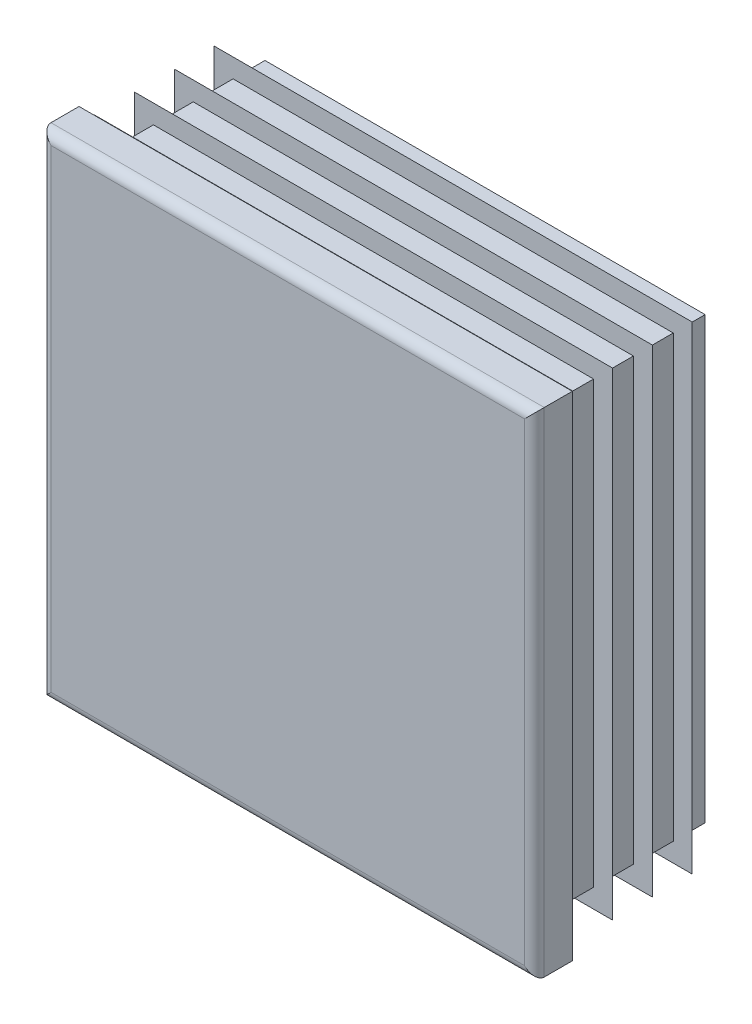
ISO-10303-21;
HEADER;
FILE_DESCRIPTION(('STEP AP214'),'2;1');
FILE_NAME('part.step','',(''),(''),'','','');
FILE_SCHEMA(('AUTOMOTIVE_DESIGN { 1 0 10303 214 1 1 1 1 }'));
ENDSEC;
DATA;
#1=APPLICATION_CONTEXT('core data for automotive mechanical design processes');
#2=APPLICATION_PROTOCOL_DEFINITION('international standard','automotive_design',2000,#1);
#3=PRODUCT_CONTEXT('',#1,'mechanical');
#4=PRODUCT('Part','Part','',(#3));
#5=PRODUCT_RELATED_PRODUCT_CATEGORY('part','',(#4));
#6=PRODUCT_DEFINITION_FORMATION('','',#4);
#7=PRODUCT_DEFINITION_CONTEXT('part definition',#1,'design');
#8=PRODUCT_DEFINITION('design','',#6,#7);
#9=PRODUCT_DEFINITION_SHAPE('','',#8);
#10=(LENGTH_UNIT() NAMED_UNIT(*) SI_UNIT(.MILLI.,.METRE.));
#11=(NAMED_UNIT(*) PLANE_ANGLE_UNIT() SI_UNIT($,.RADIAN.));
#12=(NAMED_UNIT(*) SI_UNIT($,.STERADIAN.) SOLID_ANGLE_UNIT());
#13=UNCERTAINTY_MEASURE_WITH_UNIT(LENGTH_MEASURE(1.E-05),#10,'distance_accuracy_value','');
#14=(GEOMETRIC_REPRESENTATION_CONTEXT(3) GLOBAL_UNCERTAINTY_ASSIGNED_CONTEXT((#13)) GLOBAL_UNIT_ASSIGNED_CONTEXT((#10,
#11,#12)) REPRESENTATION_CONTEXT('',''));
#15=CARTESIAN_POINT('',(0.,0.,0.));
#16=DIRECTION('',(0.,0.,1.));
#17=DIRECTION('',(1.,0.,0.));
#18=AXIS2_PLACEMENT_3D('',#15,#16,#17);
#19=CARTESIAN_POINT('',(31.2,-32.5,5.));
#20=DIRECTION('',(0.,0.,-1.));
#21=DIRECTION('',(0.,1.,0.));
#22=AXIS2_PLACEMENT_3D('',#19,#20,#21);
#23=PLANE('',#22);
#24=DIRECTION('',(0.,1.,0.));
#25=VECTOR('',#24,1.);
#26=CARTESIAN_POINT('',(-31.2,-32.5,5.));
#27=LINE('',#26,#25);
#28=CARTESIAN_POINT('',(-31.2,-31.2,5.));
#29=VERTEX_POINT('',#28);
#30=CARTESIAN_POINT('',(-31.2,31.2,5.));
#31=VERTEX_POINT('',#30);
#32=EDGE_CURVE('E262',#29,#31,#27,.T.);
#33=ORIENTED_EDGE('',*,*,#32,.F.);
#34=DIRECTION('',(-1.,0.,0.));
#35=VECTOR('',#34,1.);
#36=CARTESIAN_POINT('',(32.5,-31.2,5.));
#37=LINE('',#36,#35);
#38=CARTESIAN_POINT('',(31.2,-31.2,5.));
#39=VERTEX_POINT('',#38);
#40=EDGE_CURVE('E432',#39,#29,#37,.T.);
#41=ORIENTED_EDGE('',*,*,#40,.F.);
#42=DIRECTION('',(0.,1.,0.));
#43=VECTOR('',#42,1.);
#44=CARTESIAN_POINT('',(31.2,-32.5,5.));
#45=LINE('',#44,#43);
#46=CARTESIAN_POINT('',(31.2,31.2,5.));
#47=VERTEX_POINT('',#46);
#48=EDGE_CURVE('E257',#39,#47,#45,.T.);
#49=ORIENTED_EDGE('',*,*,#48,.T.);
#50=DIRECTION('',(-1.,0.,0.));
#51=VECTOR('',#50,1.);
#52=CARTESIAN_POINT('',(32.5,31.2,5.));
#53=LINE('',#52,#51);
#54=EDGE_CURVE('E534',#47,#31,#53,.T.);
#55=ORIENTED_EDGE('',*,*,#54,.T.);
#56=EDGE_LOOP('',(#33,#41,#49,#55));
#57=FACE_BOUND('',#56,.T.);
#58=ADVANCED_FACE('F14',(#57),#23,.F.);
#59=CARTESIAN_POINT('',(-31.2,-32.5,3.7));
#60=DIRECTION('',(0.,1.,0.));
#61=DIRECTION('',(-1.,0.,0.));
#62=AXIS2_PLACEMENT_3D('',#59,#60,#61);
#63=CYLINDRICAL_SURFACE('',#62,1.3);
#64=DIRECTION('',(0.,1.,0.));
#65=VECTOR('',#64,1.);
#66=CARTESIAN_POINT('',(-32.5,-32.5,3.7));
#67=LINE('',#66,#65);
#68=CARTESIAN_POINT('',(-32.5,-32.5,3.7));
#69=VERTEX_POINT('',#68);
#70=CARTESIAN_POINT('',(-32.5,32.5,3.7));
#71=VERTEX_POINT('',#70);
#72=EDGE_CURVE('E354',#69,#71,#67,.T.);
#73=ORIENTED_EDGE('',*,*,#72,.F.);
#74=CARTESIAN_POINT('',(-31.2,-31.2,3.7));
#75=DIRECTION('',(-0.707106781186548,0.707106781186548,0.));
#76=DIRECTION('',(0.707106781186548,0.707106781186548,0.));
#77=AXIS2_PLACEMENT_3D('',#74,#75,#76);
#78=ELLIPSE('',#77,1.83847763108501,1.3);
#79=EDGE_CURVE('E59',#69,#29,#78,.T.);
#80=ORIENTED_EDGE('',*,*,#79,.T.);
#81=ORIENTED_EDGE('',*,*,#32,.T.);
#82=CARTESIAN_POINT('',(-31.2,31.2,3.7));
#83=DIRECTION('',(0.707106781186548,0.707106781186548,0.));
#84=DIRECTION('',(-0.707106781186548,0.707106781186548,0.));
#85=AXIS2_PLACEMENT_3D('',#82,#83,#84);
#86=ELLIPSE('',#85,1.83847763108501,1.3);
#87=EDGE_CURVE('E258',#31,#71,#86,.F.);
#88=ORIENTED_EDGE('',*,*,#87,.T.);
#89=EDGE_LOOP('',(#73,#80,#81,#88));
#90=FACE_BOUND('',#89,.T.);
#91=ADVANCED_FACE('F16',(#90),#63,.T.);
#92=CARTESIAN_POINT('',(-32.5,-32.5,3.7));
#93=DIRECTION('',(1.,0.,0.));
#94=DIRECTION('',(0.,1.,0.));
#95=AXIS2_PLACEMENT_3D('',#92,#93,#94);
#96=PLANE('',#95);
#97=DIRECTION('',(0.,0.,-1.));
#98=VECTOR('',#97,1.);
#99=CARTESIAN_POINT('',(-32.5,32.5,3.7));
#100=LINE('',#99,#98);
#101=CARTESIAN_POINT('',(-32.5,32.5,0.));
#102=VERTEX_POINT('',#101);
#103=EDGE_CURVE('E519',#71,#102,#100,.T.);
#104=ORIENTED_EDGE('',*,*,#103,.T.);
#105=DIRECTION('',(0.,1.,0.));
#106=VECTOR('',#105,1.);
#107=CARTESIAN_POINT('',(-32.5,-32.5,0.));
#108=LINE('',#107,#106);
#109=CARTESIAN_POINT('',(-32.5,-32.5,0.));
#110=VERTEX_POINT('',#109);
#111=EDGE_CURVE('E352',#110,#102,#108,.T.);
#112=ORIENTED_EDGE('',*,*,#111,.F.);
#113=DIRECTION('',(0.,0.,-1.));
#114=VECTOR('',#113,1.);
#115=CARTESIAN_POINT('',(-32.5,-32.5,3.7));
#116=LINE('',#115,#114);
#117=EDGE_CURVE('E520',#69,#110,#116,.T.);
#118=ORIENTED_EDGE('',*,*,#117,.F.);
#119=ORIENTED_EDGE('',*,*,#72,.T.);
#120=EDGE_LOOP('',(#104,#112,#118,#119));
#121=FACE_BOUND('',#120,.T.);
#122=ADVANCED_FACE('F604',(#121),#96,.F.);
#123=CARTESIAN_POINT('',(-29.,-32.5,0.));
#124=DIRECTION('',(1.,0.,0.));
#125=DIRECTION('',(0.,1.,0.));
#126=AXIS2_PLACEMENT_3D('',#123,#124,#125);
#127=PLANE('',#126);
#128=DIRECTION('',(0.,1.,0.));
#129=VECTOR('',#128,1.);
#130=CARTESIAN_POINT('',(-29.,-32.5,0.));
#131=LINE('',#130,#129);
#132=CARTESIAN_POINT('',(-29.,-29.,0.));
#133=VERTEX_POINT('',#132);
#134=CARTESIAN_POINT('',(-29.,29.,0.));
#135=VERTEX_POINT('',#134);
#136=EDGE_CURVE('E349',#133,#135,#131,.T.);
#137=ORIENTED_EDGE('',*,*,#136,.T.);
#138=DIRECTION('',(0.,0.,-1.));
#139=VECTOR('',#138,1.);
#140=CARTESIAN_POINT('',(-29.,29.,0.));
#141=LINE('',#140,#139);
#142=CARTESIAN_POINT('',(-29.,29.,-1.05));
#143=VERTEX_POINT('',#142);
#144=EDGE_CURVE('E445',#135,#143,#141,.T.);
#145=ORIENTED_EDGE('',*,*,#144,.T.);
#146=DIRECTION('',(0.,1.,0.));
#147=VECTOR('',#146,1.);
#148=CARTESIAN_POINT('',(-29.,-32.5,-1.05));
#149=LINE('',#148,#147);
#150=CARTESIAN_POINT('',(-29.,-29.,-1.05));
#151=VERTEX_POINT('',#150);
#152=EDGE_CURVE('E346',#151,#143,#149,.T.);
#153=ORIENTED_EDGE('',*,*,#152,.F.);
#154=DIRECTION('',(0.,0.,1.));
#155=VECTOR('',#154,1.);
#156=CARTESIAN_POINT('',(-29.,-29.,0.));
#157=LINE('',#156,#155);
#158=EDGE_CURVE('E439',#151,#133,#157,.T.);
#159=ORIENTED_EDGE('',*,*,#158,.T.);
#160=EDGE_LOOP('',(#137,#145,#153,#159));
#161=FACE_BOUND('',#160,.T.);
#162=ADVANCED_FACE('F728',(#161),#127,.F.);
#163=CARTESIAN_POINT('',(-31.5,-32.5,-1.05));
#164=DIRECTION('',(0.573576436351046,0.,0.819152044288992));
#165=DIRECTION('',(-0.819152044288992,0.,0.573576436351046));
#166=AXIS2_PLACEMENT_3D('',#163,#164,#165);
#167=PLANE('',#166);
#168=DIRECTION('',(0.,1.,0.));
#169=VECTOR('',#168,1.);
#170=CARTESIAN_POINT('',(-31.5,-32.5,-1.05));
#171=LINE('',#170,#169);
#172=CARTESIAN_POINT('',(-31.5,-31.5,-1.05));
#173=VERTEX_POINT('',#172);
#174=CARTESIAN_POINT('',(-31.5,31.5,-1.05));
#175=VERTEX_POINT('',#174);
#176=EDGE_CURVE('E344',#173,#175,#171,.T.);
#177=ORIENTED_EDGE('',*,*,#176,.T.);
#178=DIRECTION('',(0.633687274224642,-0.633687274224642,-0.443712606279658));
#179=VECTOR('',#178,1.);
#180=CARTESIAN_POINT('',(-5.80018806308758,5.80018806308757,-19.045202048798));
#181=LINE('',#180,#179);
#182=CARTESIAN_POINT('',(-29.,29.,-2.80051884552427));
#183=VERTEX_POINT('',#182);
#184=EDGE_CURVE('E457',#175,#183,#181,.T.);
#185=ORIENTED_EDGE('',*,*,#184,.T.);
#186=DIRECTION('',(0.,1.,0.));
#187=VECTOR('',#186,1.);
#188=CARTESIAN_POINT('',(-29.,-32.5,-2.80051884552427));
#189=LINE('',#188,#187);
#190=CARTESIAN_POINT('',(-29.,-29.,-2.80051884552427));
#191=VERTEX_POINT('',#190);
#192=EDGE_CURVE('E341',#191,#183,#189,.T.);
#193=ORIENTED_EDGE('',*,*,#192,.F.);
#194=DIRECTION('',(-0.633687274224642,-0.633687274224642,0.443712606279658));
#195=VECTOR('',#194,1.);
#196=CARTESIAN_POINT('',(-31.9015595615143,-31.9015595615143,-0.768824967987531));
#197=LINE('',#196,#195);
#198=EDGE_CURVE('E451',#191,#173,#197,.T.);
#199=ORIENTED_EDGE('',*,*,#198,.T.);
#200=EDGE_LOOP('',(#177,#185,#193,#199));
#201=FACE_BOUND('',#200,.T.);
#202=ADVANCED_FACE('F732',(#201),#167,.F.);
#203=CARTESIAN_POINT('',(-29.,-32.5,-2.80051884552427));
#204=DIRECTION('',(1.,0.,0.));
#205=DIRECTION('',(0.,1.,0.));
#206=AXIS2_PLACEMENT_3D('',#203,#204,#205);
#207=PLANE('',#206);
#208=ORIENTED_EDGE('',*,*,#192,.T.);
#209=DIRECTION('',(0.,0.,-1.));
#210=VECTOR('',#209,1.);
#211=CARTESIAN_POINT('',(-29.,29.,-2.80051884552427));
#212=LINE('',#211,#210);
#213=CARTESIAN_POINT('',(-29.,29.,-6.3));
#214=VERTEX_POINT('',#213);
#215=EDGE_CURVE('E463',#183,#214,#212,.T.);
#216=ORIENTED_EDGE('',*,*,#215,.T.);
#217=DIRECTION('',(0.,1.,0.));
#218=VECTOR('',#217,1.);
#219=CARTESIAN_POINT('',(-29.,-32.5,-6.3));
#220=LINE('',#219,#218);
#221=CARTESIAN_POINT('',(-29.,-29.,-6.3));
#222=VERTEX_POINT('',#221);
#223=EDGE_CURVE('E338',#222,#214,#220,.T.);
#224=ORIENTED_EDGE('',*,*,#223,.F.);
#225=DIRECTION('',(0.,0.,1.));
#226=VECTOR('',#225,1.);
#227=CARTESIAN_POINT('',(-29.,-29.,-2.80051884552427));
#228=LINE('',#227,#226);
#229=EDGE_CURVE('E460',#222,#191,#228,.T.);
#230=ORIENTED_EDGE('',*,*,#229,.T.);
#231=EDGE_LOOP('',(#208,#216,#224,#230));
#232=FACE_BOUND('',#231,.T.);
#233=ADVANCED_FACE('F738',(#232),#207,.F.);
#234=CARTESIAN_POINT('',(-31.5,-32.5,-6.3));
#235=DIRECTION('',(0.573576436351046,0.,0.819152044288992));
#236=DIRECTION('',(-0.819152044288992,0.,0.573576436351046));
#237=AXIS2_PLACEMENT_3D('',#234,#235,#236);
#238=PLANE('',#237);
#239=DIRECTION('',(0.,1.,0.));
#240=VECTOR('',#239,1.);
#241=CARTESIAN_POINT('',(-31.5,-32.5,-6.3));
#242=LINE('',#241,#240);
#243=CARTESIAN_POINT('',(-31.5,-31.5,-6.3));
#244=VERTEX_POINT('',#243);
#245=CARTESIAN_POINT('',(-31.5,31.5,-6.3));
#246=VERTEX_POINT('',#245);
#247=EDGE_CURVE('E336',#244,#246,#242,.T.);
#248=ORIENTED_EDGE('',*,*,#247,.T.);
#249=DIRECTION('',(0.633687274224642,-0.633687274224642,-0.443712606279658));
#250=VECTOR('',#249,1.);
#251=CARTESIAN_POINT('',(-5.80018806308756,5.80018806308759,-24.2952020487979));
#252=LINE('',#251,#250);
#253=CARTESIAN_POINT('',(-29.,29.,-8.05051884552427));
#254=VERTEX_POINT('',#253);
#255=EDGE_CURVE('E475',#246,#254,#252,.T.);
#256=ORIENTED_EDGE('',*,*,#255,.T.);
#257=DIRECTION('',(0.,1.,0.));
#258=VECTOR('',#257,1.);
#259=CARTESIAN_POINT('',(-29.,-32.5,-8.05051884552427));
#260=LINE('',#259,#258);
#261=CARTESIAN_POINT('',(-29.,-29.,-8.05051884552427));
#262=VERTEX_POINT('',#261);
#263=EDGE_CURVE('E333',#262,#254,#260,.T.);
#264=ORIENTED_EDGE('',*,*,#263,.F.);
#265=DIRECTION('',(-0.633687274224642,-0.633687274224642,0.443712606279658));
#266=VECTOR('',#265,1.);
#267=CARTESIAN_POINT('',(-31.9015595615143,-31.9015595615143,-6.01882496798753));
#268=LINE('',#267,#266);
#269=EDGE_CURVE('E469',#262,#244,#268,.T.);
#270=ORIENTED_EDGE('',*,*,#269,.T.);
#271=EDGE_LOOP('',(#248,#256,#264,#270));
#272=FACE_BOUND('',#271,.T.);
#273=ADVANCED_FACE('F742',(#272),#238,.F.);
#274=CARTESIAN_POINT('',(-29.,-32.5,-8.05051884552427));
#275=DIRECTION('',(1.,0.,0.));
#276=DIRECTION('',(0.,1.,0.));
#277=AXIS2_PLACEMENT_3D('',#274,#275,#276);
#278=PLANE('',#277);
#279=ORIENTED_EDGE('',*,*,#263,.T.);
#280=DIRECTION('',(0.,0.,-1.));
#281=VECTOR('',#280,1.);
#282=CARTESIAN_POINT('',(-29.,29.,-8.05051884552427));
#283=LINE('',#282,#281);
#284=CARTESIAN_POINT('',(-29.,29.,-11.55));
#285=VERTEX_POINT('',#284);
#286=EDGE_CURVE('E481',#254,#285,#283,.T.);
#287=ORIENTED_EDGE('',*,*,#286,.T.);
#288=DIRECTION('',(0.,1.,0.));
#289=VECTOR('',#288,1.);
#290=CARTESIAN_POINT('',(-29.,-32.5,-11.55));
#291=LINE('',#290,#289);
#292=CARTESIAN_POINT('',(-29.,-29.,-11.55));
#293=VERTEX_POINT('',#292);
#294=EDGE_CURVE('E330',#293,#285,#291,.T.);
#295=ORIENTED_EDGE('',*,*,#294,.F.);
#296=DIRECTION('',(0.,0.,1.));
#297=VECTOR('',#296,1.);
#298=CARTESIAN_POINT('',(-29.,-29.,-8.05051884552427));
#299=LINE('',#298,#297);
#300=EDGE_CURVE('E478',#293,#262,#299,.T.);
#301=ORIENTED_EDGE('',*,*,#300,.T.);
#302=EDGE_LOOP('',(#279,#287,#295,#301));
#303=FACE_BOUND('',#302,.T.);
#304=ADVANCED_FACE('F746',(#303),#278,.F.);
#305=CARTESIAN_POINT('',(-31.5,-32.5,-11.55));
#306=DIRECTION('',(0.573576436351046,0.,0.819152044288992));
#307=DIRECTION('',(-0.819152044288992,0.,0.573576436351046));
#308=AXIS2_PLACEMENT_3D('',#305,#306,#307);
#309=PLANE('',#308);
#310=DIRECTION('',(0.,1.,0.));
#311=VECTOR('',#310,1.);
#312=CARTESIAN_POINT('',(-31.5,-32.5,-11.55));
#313=LINE('',#312,#311);
#314=CARTESIAN_POINT('',(-31.5,-31.5,-11.55));
#315=VERTEX_POINT('',#314);
#316=CARTESIAN_POINT('',(-31.5,31.5,-11.55));
#317=VERTEX_POINT('',#316);
#318=EDGE_CURVE('E328',#315,#317,#313,.T.);
#319=ORIENTED_EDGE('',*,*,#318,.T.);
#320=DIRECTION('',(0.633687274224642,-0.633687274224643,-0.443712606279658));
#321=VECTOR('',#320,1.);
#322=CARTESIAN_POINT('',(-5.80018806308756,5.80018806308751,-29.5452020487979));
#323=LINE('',#322,#321);
#324=CARTESIAN_POINT('',(-29.,29.,-13.3005188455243));
#325=VERTEX_POINT('',#324);
#326=EDGE_CURVE('E493',#317,#325,#323,.T.);
#327=ORIENTED_EDGE('',*,*,#326,.T.);
#328=DIRECTION('',(0.,1.,0.));
#329=VECTOR('',#328,1.);
#330=CARTESIAN_POINT('',(-29.,-32.5,-13.3005188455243));
#331=LINE('',#330,#329);
#332=CARTESIAN_POINT('',(-29.,-29.,-13.3005188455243));
#333=VERTEX_POINT('',#332);
#334=EDGE_CURVE('E325',#333,#325,#331,.T.);
#335=ORIENTED_EDGE('',*,*,#334,.F.);
#336=DIRECTION('',(-0.633687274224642,-0.633687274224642,0.443712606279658));
#337=VECTOR('',#336,1.);
#338=CARTESIAN_POINT('',(-31.9015595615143,-31.9015595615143,-11.2688249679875));
#339=LINE('',#338,#337);
#340=EDGE_CURVE('E487',#333,#315,#339,.T.);
#341=ORIENTED_EDGE('',*,*,#340,.T.);
#342=EDGE_LOOP('',(#319,#327,#335,#341));
#343=FACE_BOUND('',#342,.T.);
#344=ADVANCED_FACE('F668',(#343),#309,.F.);
#345=CARTESIAN_POINT('',(-29.,-32.5,-13.3005188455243));
#346=DIRECTION('',(1.,0.,0.));
#347=DIRECTION('',(0.,1.,0.));
#348=AXIS2_PLACEMENT_3D('',#345,#346,#347);
#349=PLANE('',#348);
#350=ORIENTED_EDGE('',*,*,#334,.T.);
#351=DIRECTION('',(0.,0.,-1.));
#352=VECTOR('',#351,1.);
#353=CARTESIAN_POINT('',(-29.,29.,-13.3005188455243));
#354=LINE('',#353,#352);
#355=CARTESIAN_POINT('',(-29.,29.,-16.8));
#356=VERTEX_POINT('',#355);
#357=EDGE_CURVE('E499',#325,#356,#354,.T.);
#358=ORIENTED_EDGE('',*,*,#357,.T.);
#359=DIRECTION('',(0.,1.,0.));
#360=VECTOR('',#359,1.);
#361=CARTESIAN_POINT('',(-29.,-32.5,-16.8));
#362=LINE('',#361,#360);
#363=CARTESIAN_POINT('',(-29.,-29.,-16.8));
#364=VERTEX_POINT('',#363);
#365=EDGE_CURVE('E322',#364,#356,#362,.T.);
#366=ORIENTED_EDGE('',*,*,#365,.F.);
#367=DIRECTION('',(0.,0.,1.));
#368=VECTOR('',#367,1.);
#369=CARTESIAN_POINT('',(-29.,-29.,-13.3005188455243));
#370=LINE('',#369,#368);
#371=EDGE_CURVE('E496',#364,#333,#370,.T.);
#372=ORIENTED_EDGE('',*,*,#371,.T.);
#373=EDGE_LOOP('',(#350,#358,#366,#372));
#374=FACE_BOUND('',#373,.T.);
#375=ADVANCED_FACE('F665',(#374),#349,.F.);
#376=CARTESIAN_POINT('',(-31.5,-32.5,-16.8));
#377=DIRECTION('',(0.573576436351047,0.,0.819152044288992));
#378=DIRECTION('',(-0.819152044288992,0.,0.573576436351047));
#379=AXIS2_PLACEMENT_3D('',#376,#377,#378);
#380=PLANE('',#379);
#381=DIRECTION('',(0.,1.,0.));
#382=VECTOR('',#381,1.);
#383=CARTESIAN_POINT('',(-31.5,-32.5,-16.8));
#384=LINE('',#383,#382);
#385=CARTESIAN_POINT('',(-31.5,-31.5,-16.8));
#386=VERTEX_POINT('',#385);
#387=CARTESIAN_POINT('',(-31.5,31.5,-16.8));
#388=VERTEX_POINT('',#387);
#389=EDGE_CURVE('E320',#386,#388,#384,.T.);
#390=ORIENTED_EDGE('',*,*,#389,.T.);
#391=DIRECTION('',(0.633687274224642,-0.633687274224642,-0.443712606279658));
#392=VECTOR('',#391,1.);
#393=CARTESIAN_POINT('',(-5.80018806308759,5.80018806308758,-34.795202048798));
#394=LINE('',#393,#392);
#395=CARTESIAN_POINT('',(-29.,29.,-18.5505188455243));
#396=VERTEX_POINT('',#395);
#397=EDGE_CURVE('E511',#388,#396,#394,.T.);
#398=ORIENTED_EDGE('',*,*,#397,.T.);
#399=DIRECTION('',(0.,1.,0.));
#400=VECTOR('',#399,1.);
#401=CARTESIAN_POINT('',(-29.,-32.5,-18.5505188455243));
#402=LINE('',#401,#400);
#403=CARTESIAN_POINT('',(-29.,-29.,-18.5505188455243));
#404=VERTEX_POINT('',#403);
#405=EDGE_CURVE('E317',#404,#396,#402,.T.);
#406=ORIENTED_EDGE('',*,*,#405,.F.);
#407=DIRECTION('',(-0.633687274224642,-0.633687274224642,0.443712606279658));
#408=VECTOR('',#407,1.);
#409=CARTESIAN_POINT('',(-31.9015595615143,-31.9015595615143,-16.5188249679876));
#410=LINE('',#409,#408);
#411=EDGE_CURVE('E505',#404,#386,#410,.T.);
#412=ORIENTED_EDGE('',*,*,#411,.T.);
#413=EDGE_LOOP('',(#390,#398,#406,#412));
#414=FACE_BOUND('',#413,.T.);
#415=ADVANCED_FACE('F580',(#414),#380,.F.);
#416=CARTESIAN_POINT('',(-29.,-32.5,-18.5505188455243));
#417=DIRECTION('',(1.,0.,0.));
#418=DIRECTION('',(0.,1.,0.));
#419=AXIS2_PLACEMENT_3D('',#416,#417,#418);
#420=PLANE('',#419);
#421=ORIENTED_EDGE('',*,*,#405,.T.);
#422=DIRECTION('',(0.,0.,-1.));
#423=VECTOR('',#422,1.);
#424=CARTESIAN_POINT('',(-29.,29.,-18.5505188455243));
#425=LINE('',#424,#423);
#426=CARTESIAN_POINT('',(-29.,29.,-21.));
#427=VERTEX_POINT('',#426);
#428=EDGE_CURVE('E517',#396,#427,#425,.T.);
#429=ORIENTED_EDGE('',*,*,#428,.T.);
#430=DIRECTION('',(0.,1.,0.));
#431=VECTOR('',#430,1.);
#432=CARTESIAN_POINT('',(-29.,-32.5,-21.));
#433=LINE('',#432,#431);
#434=CARTESIAN_POINT('',(-29.,-29.,-21.));
#435=VERTEX_POINT('',#434);
#436=EDGE_CURVE('E314',#435,#427,#433,.T.);
#437=ORIENTED_EDGE('',*,*,#436,.F.);
#438=DIRECTION('',(0.,0.,1.));
#439=VECTOR('',#438,1.);
#440=CARTESIAN_POINT('',(-29.,-29.,-18.5505188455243));
#441=LINE('',#440,#439);
#442=EDGE_CURVE('E514',#435,#404,#441,.T.);
#443=ORIENTED_EDGE('',*,*,#442,.T.);
#444=EDGE_LOOP('',(#421,#429,#437,#443));
#445=FACE_BOUND('',#444,.T.);
#446=ADVANCED_FACE('F582',(#445),#420,.F.);
#447=CARTESIAN_POINT('',(-29.,-32.5,-21.));
#448=DIRECTION('',(0.,0.,1.));
#449=DIRECTION('',(0.,-1.,0.));
#450=AXIS2_PLACEMENT_3D('',#447,#448,#449);
#451=PLANE('',#450);
#452=ORIENTED_EDGE('',*,*,#436,.T.);
#453=DIRECTION('',(-1.,0.,0.));
#454=VECTOR('',#453,1.);
#455=CARTESIAN_POINT('',(32.5,29.,-21.));
#456=LINE('',#455,#454);
#457=CARTESIAN_POINT('',(29.,29.,-21.));
#458=VERTEX_POINT('',#457);
#459=EDGE_CURVE('E388',#458,#427,#456,.T.);
#460=ORIENTED_EDGE('',*,*,#459,.F.);
#461=DIRECTION('',(0.,1.,0.));
#462=VECTOR('',#461,1.);
#463=CARTESIAN_POINT('',(29.,-32.5,-21.));
#464=LINE('',#463,#462);
#465=CARTESIAN_POINT('',(29.,-29.,-21.));
#466=VERTEX_POINT('',#465);
#467=EDGE_CURVE('E311',#466,#458,#464,.T.);
#468=ORIENTED_EDGE('',*,*,#467,.F.);
#469=DIRECTION('',(-1.,0.,0.));
#470=VECTOR('',#469,1.);
#471=CARTESIAN_POINT('',(32.5,-29.,-21.));
#472=LINE('',#471,#470);
#473=EDGE_CURVE('E386',#466,#435,#472,.T.);
#474=ORIENTED_EDGE('',*,*,#473,.T.);
#475=EDGE_LOOP('',(#452,#460,#468,#474));
#476=FACE_BOUND('',#475,.T.);
#477=ADVANCED_FACE('F385',(#476),#451,.F.);
#478=CARTESIAN_POINT('',(29.,-32.5,-21.));
#479=DIRECTION('',(-1.,0.,0.));
#480=DIRECTION('',(0.,-1.,0.));
#481=AXIS2_PLACEMENT_3D('',#478,#479,#480);
#482=PLANE('',#481);
#483=ORIENTED_EDGE('',*,*,#467,.T.);
#484=DIRECTION('',(0.,0.,1.));
#485=VECTOR('',#484,1.);
#486=CARTESIAN_POINT('',(29.,29.,-21.));
#487=LINE('',#486,#485);
#488=CARTESIAN_POINT('',(29.,29.,-18.5505188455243));
#489=VERTEX_POINT('',#488);
#490=EDGE_CURVE('E9',#458,#489,#487,.T.);
#491=ORIENTED_EDGE('',*,*,#490,.T.);
#492=DIRECTION('',(0.,1.,0.));
#493=VECTOR('',#492,1.);
#494=CARTESIAN_POINT('',(29.,-32.5,-18.5505188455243));
#495=LINE('',#494,#493);
#496=CARTESIAN_POINT('',(29.,-29.,-18.5505188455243));
#497=VERTEX_POINT('',#496);
#498=EDGE_CURVE('E308',#497,#489,#495,.T.);
#499=ORIENTED_EDGE('',*,*,#498,.F.);
#500=DIRECTION('',(0.,0.,-1.));
#501=VECTOR('',#500,1.);
#502=CARTESIAN_POINT('',(29.,-29.,-21.));
#503=LINE('',#502,#501);
#504=EDGE_CURVE('E23',#497,#466,#503,.T.);
#505=ORIENTED_EDGE('',*,*,#504,.T.);
#506=EDGE_LOOP('',(#483,#491,#499,#505));
#507=FACE_BOUND('',#506,.T.);
#508=ADVANCED_FACE('F378',(#507),#482,.F.);
#509=CARTESIAN_POINT('',(29.,-32.5,-18.5505188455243));
#510=DIRECTION('',(-0.573576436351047,0.,0.819152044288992));
#511=DIRECTION('',(-0.819152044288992,0.,-0.573576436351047));
#512=AXIS2_PLACEMENT_3D('',#509,#510,#511);
#513=PLANE('',#512);
#514=ORIENTED_EDGE('',*,*,#498,.T.);
#515=DIRECTION('',(0.633687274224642,0.633687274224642,0.443712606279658));
#516=VECTOR('',#515,1.);
#517=CARTESIAN_POINT('',(4.30408696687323,4.30408696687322,-35.8427833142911));
#518=LINE('',#517,#516);
#519=CARTESIAN_POINT('',(31.5,31.5,-16.8));
#520=VERTEX_POINT('',#519);
#521=EDGE_CURVE('E508',#489,#520,#518,.T.);
#522=ORIENTED_EDGE('',*,*,#521,.T.);
#523=DIRECTION('',(0.,1.,0.));
#524=VECTOR('',#523,1.);
#525=CARTESIAN_POINT('',(31.5,-32.5,-16.8));
#526=LINE('',#525,#524);
#527=CARTESIAN_POINT('',(31.5,-31.5,-16.8));
#528=VERTEX_POINT('',#527);
#529=EDGE_CURVE('E305',#528,#520,#526,.T.);
#530=ORIENTED_EDGE('',*,*,#529,.F.);
#531=DIRECTION('',(-0.633687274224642,0.633687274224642,-0.443712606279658));
#532=VECTOR('',#531,1.);
#533=CARTESIAN_POINT('',(30.4054584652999,-30.4054584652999,-17.5664062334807));
#534=LINE('',#533,#532);
#535=EDGE_CURVE('E502',#528,#497,#534,.T.);
#536=ORIENTED_EDGE('',*,*,#535,.T.);
#537=EDGE_LOOP('',(#514,#522,#530,#536));
#538=FACE_BOUND('',#537,.T.);
#539=ADVANCED_FACE('F588',(#538),#513,.F.);
#540=CARTESIAN_POINT('',(31.5,-32.5,-16.8));
#541=DIRECTION('',(0.,0.,-1.));
#542=DIRECTION('',(0.,1.,0.));
#543=AXIS2_PLACEMENT_3D('',#540,#541,#542);
#544=PLANE('',#543);
#545=ORIENTED_EDGE('',*,*,#529,.T.);
#546=DIRECTION('',(-1.,0.,0.));
#547=VECTOR('',#546,1.);
#548=CARTESIAN_POINT('',(32.5,31.5,-16.8));
#549=LINE('',#548,#547);
#550=EDGE_CURVE('E394',#520,#388,#549,.T.);
#551=ORIENTED_EDGE('',*,*,#550,.T.);
#552=ORIENTED_EDGE('',*,*,#389,.F.);
#553=DIRECTION('',(-1.,0.,0.));
#554=VECTOR('',#553,1.);
#555=CARTESIAN_POINT('',(32.5,-31.5,-16.8));
#556=LINE('',#555,#554);
#557=EDGE_CURVE('E401',#528,#386,#556,.T.);
#558=ORIENTED_EDGE('',*,*,#557,.F.);
#559=EDGE_LOOP('',(#545,#551,#552,#558));
#560=FACE_BOUND('',#559,.T.);
#561=ORIENTED_EDGE('',*,*,#365,.T.);
#562=DIRECTION('',(-1.,0.,0.));
#563=VECTOR('',#562,1.);
#564=CARTESIAN_POINT('',(32.5,29.,-16.8));
#565=LINE('',#564,#563);
#566=CARTESIAN_POINT('',(29.,29.,-16.8));
#567=VERTEX_POINT('',#566);
#568=EDGE_CURVE('E567',#567,#356,#565,.T.);
#569=ORIENTED_EDGE('',*,*,#568,.F.);
#570=DIRECTION('',(0.,1.,0.));
#571=VECTOR('',#570,1.);
#572=CARTESIAN_POINT('',(29.,-32.5,-16.8));
#573=LINE('',#572,#571);
#574=CARTESIAN_POINT('',(29.,-29.,-16.8));
#575=VERTEX_POINT('',#574);
#576=EDGE_CURVE('E302',#575,#567,#573,.T.);
#577=ORIENTED_EDGE('',*,*,#576,.F.);
#578=DIRECTION('',(-1.,0.,0.));
#579=VECTOR('',#578,1.);
#580=CARTESIAN_POINT('',(32.5,-29.,-16.8));
#581=LINE('',#580,#579);
#582=EDGE_CURVE('E403',#575,#364,#581,.T.);
#583=ORIENTED_EDGE('',*,*,#582,.T.);
#584=EDGE_LOOP('',(#561,#569,#577,#583));
#585=FACE_BOUND('',#584,.T.);
#586=ADVANCED_FACE('F571',(#560,#585),#544,.F.);
#587=CARTESIAN_POINT('',(29.,-32.5,-16.8));
#588=DIRECTION('',(-1.,0.,0.));
#589=DIRECTION('',(0.,-1.,0.));
#590=AXIS2_PLACEMENT_3D('',#587,#588,#589);
#591=PLANE('',#590);
#592=ORIENTED_EDGE('',*,*,#576,.T.);
#593=DIRECTION('',(0.,0.,1.));
#594=VECTOR('',#593,1.);
#595=CARTESIAN_POINT('',(29.,29.,-16.8));
#596=LINE('',#595,#594);
#597=CARTESIAN_POINT('',(29.,29.,-13.3005188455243));
#598=VERTEX_POINT('',#597);
#599=EDGE_CURVE('E372',#567,#598,#596,.T.);
#600=ORIENTED_EDGE('',*,*,#599,.T.);
#601=DIRECTION('',(0.,1.,0.));
#602=VECTOR('',#601,1.);
#603=CARTESIAN_POINT('',(29.,-32.5,-13.3005188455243));
#604=LINE('',#603,#602);
#605=CARTESIAN_POINT('',(29.,-29.,-13.3005188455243));
#606=VERTEX_POINT('',#605);
#607=EDGE_CURVE('E299',#606,#598,#604,.T.);
#608=ORIENTED_EDGE('',*,*,#607,.F.);
#609=DIRECTION('',(0.,0.,-1.));
#610=VECTOR('',#609,1.);
#611=CARTESIAN_POINT('',(29.,-29.,-16.8));
#612=LINE('',#611,#610);
#613=EDGE_CURVE('E369',#606,#575,#612,.T.);
#614=ORIENTED_EDGE('',*,*,#613,.T.);
#615=EDGE_LOOP('',(#592,#600,#608,#614));
#616=FACE_BOUND('',#615,.T.);
#617=ADVANCED_FACE('F596',(#616),#591,.F.);
#618=CARTESIAN_POINT('',(29.,-32.5,-13.3005188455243));
#619=DIRECTION('',(-0.573576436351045,0.,0.819152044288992));
#620=DIRECTION('',(-0.819152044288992,0.,-0.573576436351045));
#621=AXIS2_PLACEMENT_3D('',#618,#619,#620);
#622=PLANE('',#621);
#623=ORIENTED_EDGE('',*,*,#607,.T.);
#624=DIRECTION('',(0.633687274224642,0.633687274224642,0.443712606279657));
#625=VECTOR('',#624,1.);
#626=CARTESIAN_POINT('',(4.3040869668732,4.30408696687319,-30.5927833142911));
#627=LINE('',#626,#625);
#628=CARTESIAN_POINT('',(31.5,31.5,-11.55));
#629=VERTEX_POINT('',#628);
#630=EDGE_CURVE('E490',#598,#629,#627,.T.);
#631=ORIENTED_EDGE('',*,*,#630,.T.);
#632=DIRECTION('',(0.,1.,0.));
#633=VECTOR('',#632,1.);
#634=CARTESIAN_POINT('',(31.5,-32.5,-11.55));
#635=LINE('',#634,#633);
#636=CARTESIAN_POINT('',(31.5,-31.5,-11.55));
#637=VERTEX_POINT('',#636);
#638=EDGE_CURVE('E296',#637,#629,#635,.T.);
#639=ORIENTED_EDGE('',*,*,#638,.F.);
#640=DIRECTION('',(-0.633687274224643,0.633687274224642,-0.443712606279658));
#641=VECTOR('',#640,1.);
#642=CARTESIAN_POINT('',(30.4054584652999,-30.4054584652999,-12.3164062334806));
#643=LINE('',#642,#641);
#644=EDGE_CURVE('E484',#637,#606,#643,.T.);
#645=ORIENTED_EDGE('',*,*,#644,.T.);
#646=EDGE_LOOP('',(#623,#631,#639,#645));
#647=FACE_BOUND('',#646,.T.);
#648=ADVANCED_FACE('F648',(#647),#622,.F.);
#649=CARTESIAN_POINT('',(31.5,-32.5,-11.55));
#650=DIRECTION('',(0.,0.,-1.));
#651=DIRECTION('',(0.,1.,0.));
#652=AXIS2_PLACEMENT_3D('',#649,#650,#651);
#653=PLANE('',#652);
#654=ORIENTED_EDGE('',*,*,#638,.T.);
#655=DIRECTION('',(-1.,0.,0.));
#656=VECTOR('',#655,1.);
#657=CARTESIAN_POINT('',(32.5,31.5,-11.55));
#658=LINE('',#657,#656);
#659=EDGE_CURVE('E561',#629,#317,#658,.T.);
#660=ORIENTED_EDGE('',*,*,#659,.T.);
#661=ORIENTED_EDGE('',*,*,#318,.F.);
#662=DIRECTION('',(-1.,0.,0.));
#663=VECTOR('',#662,1.);
#664=CARTESIAN_POINT('',(32.5,-31.5,-11.55));
#665=LINE('',#664,#663);
#666=EDGE_CURVE('E409',#637,#315,#665,.T.);
#667=ORIENTED_EDGE('',*,*,#666,.F.);
#668=EDGE_LOOP('',(#654,#660,#661,#667));
#669=FACE_BOUND('',#668,.T.);
#670=ORIENTED_EDGE('',*,*,#294,.T.);
#671=DIRECTION('',(-1.,0.,0.));
#672=VECTOR('',#671,1.);
#673=CARTESIAN_POINT('',(32.5,29.,-11.55));
#674=LINE('',#673,#672);
#675=CARTESIAN_POINT('',(29.,29.,-11.55));
#676=VERTEX_POINT('',#675);
#677=EDGE_CURVE('E559',#676,#285,#674,.T.);
#678=ORIENTED_EDGE('',*,*,#677,.F.);
#679=DIRECTION('',(0.,1.,0.));
#680=VECTOR('',#679,1.);
#681=CARTESIAN_POINT('',(29.,-32.5,-11.55));
#682=LINE('',#681,#680);
#683=CARTESIAN_POINT('',(29.,-29.,-11.55));
#684=VERTEX_POINT('',#683);
#685=EDGE_CURVE('E293',#684,#676,#682,.T.);
#686=ORIENTED_EDGE('',*,*,#685,.F.);
#687=DIRECTION('',(-1.,0.,0.));
#688=VECTOR('',#687,1.);
#689=CARTESIAN_POINT('',(32.5,-29.,-11.55));
#690=LINE('',#689,#688);
#691=EDGE_CURVE('E411',#684,#293,#690,.T.);
#692=ORIENTED_EDGE('',*,*,#691,.T.);
#693=EDGE_LOOP('',(#670,#678,#686,#692));
#694=FACE_BOUND('',#693,.T.);
#695=ADVANCED_FACE('F644',(#669,#694),#653,.F.);
#696=CARTESIAN_POINT('',(29.,-32.5,-11.55));
#697=DIRECTION('',(-1.,0.,0.));
#698=DIRECTION('',(0.,-1.,0.));
#699=AXIS2_PLACEMENT_3D('',#696,#697,#698);
#700=PLANE('',#699);
#701=ORIENTED_EDGE('',*,*,#685,.T.);
#702=DIRECTION('',(0.,0.,1.));
#703=VECTOR('',#702,1.);
#704=CARTESIAN_POINT('',(29.,29.,-11.55));
#705=LINE('',#704,#703);
#706=CARTESIAN_POINT('',(29.,29.,-8.05051884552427));
#707=VERTEX_POINT('',#706);
#708=EDGE_CURVE('E366',#676,#707,#705,.T.);
#709=ORIENTED_EDGE('',*,*,#708,.T.);
#710=DIRECTION('',(0.,1.,0.));
#711=VECTOR('',#710,1.);
#712=CARTESIAN_POINT('',(29.,-32.5,-8.05051884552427));
#713=LINE('',#712,#711);
#714=CARTESIAN_POINT('',(29.,-29.,-8.05051884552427));
#715=VERTEX_POINT('',#714);
#716=EDGE_CURVE('E290',#715,#707,#713,.T.);
#717=ORIENTED_EDGE('',*,*,#716,.F.);
#718=DIRECTION('',(0.,0.,-1.));
#719=VECTOR('',#718,1.);
#720=CARTESIAN_POINT('',(29.,-29.,-11.55));
#721=LINE('',#720,#719);
#722=EDGE_CURVE('E363',#715,#684,#721,.T.);
#723=ORIENTED_EDGE('',*,*,#722,.T.);
#724=EDGE_LOOP('',(#701,#709,#717,#723));
#725=FACE_BOUND('',#724,.T.);
#726=ADVANCED_FACE('F640',(#725),#700,.F.);
#727=CARTESIAN_POINT('',(29.,-32.5,-8.05051884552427));
#728=DIRECTION('',(-0.573576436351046,0.,0.819152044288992));
#729=DIRECTION('',(-0.819152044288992,0.,-0.573576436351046));
#730=AXIS2_PLACEMENT_3D('',#727,#728,#729);
#731=PLANE('',#730);
#732=ORIENTED_EDGE('',*,*,#716,.T.);
#733=DIRECTION('',(0.633687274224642,0.633687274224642,0.443712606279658));
#734=VECTOR('',#733,1.);
#735=CARTESIAN_POINT('',(4.30408696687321,4.30408696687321,-25.3427833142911));
#736=LINE('',#735,#734);
#737=CARTESIAN_POINT('',(31.5,31.5,-6.3));
#738=VERTEX_POINT('',#737);
#739=EDGE_CURVE('E472',#707,#738,#736,.T.);
#740=ORIENTED_EDGE('',*,*,#739,.T.);
#741=DIRECTION('',(0.,1.,0.));
#742=VECTOR('',#741,1.);
#743=CARTESIAN_POINT('',(31.5,-32.5,-6.3));
#744=LINE('',#743,#742);
#745=CARTESIAN_POINT('',(31.5,-31.5,-6.3));
#746=VERTEX_POINT('',#745);
#747=EDGE_CURVE('E287',#746,#738,#744,.T.);
#748=ORIENTED_EDGE('',*,*,#747,.F.);
#749=DIRECTION('',(-0.633687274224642,0.633687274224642,-0.443712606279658));
#750=VECTOR('',#749,1.);
#751=CARTESIAN_POINT('',(30.4054584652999,-30.4054584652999,-7.06640623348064));
#752=LINE('',#751,#750);
#753=EDGE_CURVE('E466',#746,#715,#752,.T.);
#754=ORIENTED_EDGE('',*,*,#753,.T.);
#755=EDGE_LOOP('',(#732,#740,#748,#754));
#756=FACE_BOUND('',#755,.T.);
#757=ADVANCED_FACE('F636',(#756),#731,.F.);
#758=CARTESIAN_POINT('',(31.5,-32.5,-6.3));
#759=DIRECTION('',(0.,0.,-1.));
#760=DIRECTION('',(0.,1.,0.));
#761=AXIS2_PLACEMENT_3D('',#758,#759,#760);
#762=PLANE('',#761);
#763=ORIENTED_EDGE('',*,*,#747,.T.);
#764=DIRECTION('',(-1.,0.,0.));
#765=VECTOR('',#764,1.);
#766=CARTESIAN_POINT('',(32.5,31.5,-6.3));
#767=LINE('',#766,#765);
#768=EDGE_CURVE('E553',#738,#246,#767,.T.);
#769=ORIENTED_EDGE('',*,*,#768,.T.);
#770=ORIENTED_EDGE('',*,*,#247,.F.);
#771=DIRECTION('',(-1.,0.,0.));
#772=VECTOR('',#771,1.);
#773=CARTESIAN_POINT('',(32.5,-31.5,-6.3));
#774=LINE('',#773,#772);
#775=EDGE_CURVE('E417',#746,#244,#774,.T.);
#776=ORIENTED_EDGE('',*,*,#775,.F.);
#777=EDGE_LOOP('',(#763,#769,#770,#776));
#778=FACE_BOUND('',#777,.T.);
#779=ORIENTED_EDGE('',*,*,#223,.T.);
#780=DIRECTION('',(-1.,0.,0.));
#781=VECTOR('',#780,1.);
#782=CARTESIAN_POINT('',(32.5,29.,-6.3));
#783=LINE('',#782,#781);
#784=CARTESIAN_POINT('',(29.,29.,-6.3));
#785=VERTEX_POINT('',#784);
#786=EDGE_CURVE('E551',#785,#214,#783,.T.);
#787=ORIENTED_EDGE('',*,*,#786,.F.);
#788=DIRECTION('',(0.,1.,0.));
#789=VECTOR('',#788,1.);
#790=CARTESIAN_POINT('',(29.,-32.5,-6.3));
#791=LINE('',#790,#789);
#792=CARTESIAN_POINT('',(29.,-29.,-6.3));
#793=VERTEX_POINT('',#792);
#794=EDGE_CURVE('E284',#793,#785,#791,.T.);
#795=ORIENTED_EDGE('',*,*,#794,.F.);
#796=DIRECTION('',(-1.,0.,0.));
#797=VECTOR('',#796,1.);
#798=CARTESIAN_POINT('',(32.5,-29.,-6.3));
#799=LINE('',#798,#797);
#800=EDGE_CURVE('E419',#793,#222,#799,.T.);
#801=ORIENTED_EDGE('',*,*,#800,.T.);
#802=EDGE_LOOP('',(#779,#787,#795,#801));
#803=FACE_BOUND('',#802,.T.);
#804=ADVANCED_FACE('F632',(#778,#803),#762,.F.);
#805=CARTESIAN_POINT('',(29.,-32.5,-6.3));
#806=DIRECTION('',(-1.,0.,0.));
#807=DIRECTION('',(0.,-1.,0.));
#808=AXIS2_PLACEMENT_3D('',#805,#806,#807);
#809=PLANE('',#808);
#810=ORIENTED_EDGE('',*,*,#794,.T.);
#811=DIRECTION('',(0.,0.,1.));
#812=VECTOR('',#811,1.);
#813=CARTESIAN_POINT('',(29.,29.,-6.3));
#814=LINE('',#813,#812);
#815=CARTESIAN_POINT('',(29.,29.,-2.80051884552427));
#816=VERTEX_POINT('',#815);
#817=EDGE_CURVE('E360',#785,#816,#814,.T.);
#818=ORIENTED_EDGE('',*,*,#817,.T.);
#819=DIRECTION('',(0.,1.,0.));
#820=VECTOR('',#819,1.);
#821=CARTESIAN_POINT('',(29.,-32.5,-2.80051884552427));
#822=LINE('',#821,#820);
#823=CARTESIAN_POINT('',(29.,-29.,-2.80051884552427));
#824=VERTEX_POINT('',#823);
#825=EDGE_CURVE('E281',#824,#816,#822,.T.);
#826=ORIENTED_EDGE('',*,*,#825,.F.);
#827=DIRECTION('',(0.,0.,-1.));
#828=VECTOR('',#827,1.);
#829=CARTESIAN_POINT('',(29.,-29.,-6.3));
#830=LINE('',#829,#828);
#831=EDGE_CURVE('E357',#824,#793,#830,.T.);
#832=ORIENTED_EDGE('',*,*,#831,.T.);
#833=EDGE_LOOP('',(#810,#818,#826,#832));
#834=FACE_BOUND('',#833,.T.);
#835=ADVANCED_FACE('F628',(#834),#809,.F.);
#836=CARTESIAN_POINT('',(29.,-32.5,-2.80051884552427));
#837=DIRECTION('',(-0.573576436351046,0.,0.819152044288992));
#838=DIRECTION('',(-0.819152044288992,0.,-0.573576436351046));
#839=AXIS2_PLACEMENT_3D('',#836,#837,#838);
#840=PLANE('',#839);
#841=ORIENTED_EDGE('',*,*,#825,.T.);
#842=DIRECTION('',(0.633687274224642,0.633687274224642,0.443712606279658));
#843=VECTOR('',#842,1.);
#844=CARTESIAN_POINT('',(4.30408696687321,4.30408696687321,-20.0927833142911));
#845=LINE('',#844,#843);
#846=CARTESIAN_POINT('',(31.5,31.5,-1.05));
#847=VERTEX_POINT('',#846);
#848=EDGE_CURVE('E454',#816,#847,#845,.T.);
#849=ORIENTED_EDGE('',*,*,#848,.T.);
#850=DIRECTION('',(0.,1.,0.));
#851=VECTOR('',#850,1.);
#852=CARTESIAN_POINT('',(31.5,-32.5,-1.05));
#853=LINE('',#852,#851);
#854=CARTESIAN_POINT('',(31.5,-31.5,-1.05));
#855=VERTEX_POINT('',#854);
#856=EDGE_CURVE('E278',#855,#847,#853,.T.);
#857=ORIENTED_EDGE('',*,*,#856,.F.);
#858=DIRECTION('',(-0.633687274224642,0.633687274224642,-0.443712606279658));
#859=VECTOR('',#858,1.);
#860=CARTESIAN_POINT('',(30.4054584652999,-30.4054584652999,-1.81640623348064));
#861=LINE('',#860,#859);
#862=EDGE_CURVE('E448',#855,#824,#861,.T.);
#863=ORIENTED_EDGE('',*,*,#862,.T.);
#864=EDGE_LOOP('',(#841,#849,#857,#863));
#865=FACE_BOUND('',#864,.T.);
#866=ADVANCED_FACE('F624',(#865),#840,.F.);
#867=CARTESIAN_POINT('',(31.5,-32.5,-1.05));
#868=DIRECTION('',(0.,0.,-1.));
#869=DIRECTION('',(0.,1.,0.));
#870=AXIS2_PLACEMENT_3D('',#867,#868,#869);
#871=PLANE('',#870);
#872=ORIENTED_EDGE('',*,*,#856,.T.);
#873=DIRECTION('',(-1.,0.,0.));
#874=VECTOR('',#873,1.);
#875=CARTESIAN_POINT('',(32.5,31.5,-1.05));
#876=LINE('',#875,#874);
#877=EDGE_CURVE('E545',#847,#175,#876,.T.);
#878=ORIENTED_EDGE('',*,*,#877,.T.);
#879=ORIENTED_EDGE('',*,*,#176,.F.);
#880=DIRECTION('',(-1.,0.,0.));
#881=VECTOR('',#880,1.);
#882=CARTESIAN_POINT('',(32.5,-31.5,-1.05));
#883=LINE('',#882,#881);
#884=EDGE_CURVE('E425',#855,#173,#883,.T.);
#885=ORIENTED_EDGE('',*,*,#884,.F.);
#886=EDGE_LOOP('',(#872,#878,#879,#885));
#887=FACE_BOUND('',#886,.T.);
#888=ORIENTED_EDGE('',*,*,#152,.T.);
#889=DIRECTION('',(-1.,0.,0.));
#890=VECTOR('',#889,1.);
#891=CARTESIAN_POINT('',(32.5,29.,-1.05));
#892=LINE('',#891,#890);
#893=CARTESIAN_POINT('',(29.,29.,-1.05));
#894=VERTEX_POINT('',#893);
#895=EDGE_CURVE('E543',#894,#143,#892,.T.);
#896=ORIENTED_EDGE('',*,*,#895,.F.);
#897=DIRECTION('',(0.,1.,0.));
#898=VECTOR('',#897,1.);
#899=CARTESIAN_POINT('',(29.,-32.5,-1.05));
#900=LINE('',#899,#898);
#901=CARTESIAN_POINT('',(29.,-29.,-1.05));
#902=VERTEX_POINT('',#901);
#903=EDGE_CURVE('E275',#902,#894,#900,.T.);
#904=ORIENTED_EDGE('',*,*,#903,.F.);
#905=DIRECTION('',(-1.,0.,0.));
#906=VECTOR('',#905,1.);
#907=CARTESIAN_POINT('',(32.5,-29.,-1.05));
#908=LINE('',#907,#906);
#909=EDGE_CURVE('E427',#902,#151,#908,.T.);
#910=ORIENTED_EDGE('',*,*,#909,.T.);
#911=EDGE_LOOP('',(#888,#896,#904,#910));
#912=FACE_BOUND('',#911,.T.);
#913=ADVANCED_FACE('F620',(#887,#912),#871,.F.);
#914=CARTESIAN_POINT('',(29.,-32.5,-1.05));
#915=DIRECTION('',(-1.,0.,0.));
#916=DIRECTION('',(0.,-1.,0.));
#917=AXIS2_PLACEMENT_3D('',#914,#915,#916);
#918=PLANE('',#917);
#919=ORIENTED_EDGE('',*,*,#903,.T.);
#920=DIRECTION('',(0.,0.,1.));
#921=VECTOR('',#920,1.);
#922=CARTESIAN_POINT('',(29.,29.,-1.05));
#923=LINE('',#922,#921);
#924=CARTESIAN_POINT('',(29.,29.,0.));
#925=VERTEX_POINT('',#924);
#926=EDGE_CURVE('E442',#894,#925,#923,.T.);
#927=ORIENTED_EDGE('',*,*,#926,.T.);
#928=DIRECTION('',(0.,1.,0.));
#929=VECTOR('',#928,1.);
#930=CARTESIAN_POINT('',(29.,-32.5,0.));
#931=LINE('',#930,#929);
#932=CARTESIAN_POINT('',(29.,-29.,0.));
#933=VERTEX_POINT('',#932);
#934=EDGE_CURVE('E268',#933,#925,#931,.T.);
#935=ORIENTED_EDGE('',*,*,#934,.F.);
#936=DIRECTION('',(0.,0.,-1.));
#937=VECTOR('',#936,1.);
#938=CARTESIAN_POINT('',(29.,-29.,-1.05));
#939=LINE('',#938,#937);
#940=EDGE_CURVE('E436',#933,#902,#939,.T.);
#941=ORIENTED_EDGE('',*,*,#940,.T.);
#942=EDGE_LOOP('',(#919,#927,#935,#941));
#943=FACE_BOUND('',#942,.T.);
#944=ADVANCED_FACE('F616',(#943),#918,.F.);
#945=CARTESIAN_POINT('',(29.,-32.5,0.));
#946=DIRECTION('',(0.,0.,1.));
#947=DIRECTION('',(0.,-1.,0.));
#948=AXIS2_PLACEMENT_3D('',#945,#946,#947);
#949=PLANE('',#948);
#950=DIRECTION('',(-1.,0.,0.));
#951=VECTOR('',#950,1.);
#952=CARTESIAN_POINT('',(32.5,29.,0.));
#953=LINE('',#952,#951);
#954=EDGE_CURVE('E538',#925,#135,#953,.T.);
#955=ORIENTED_EDGE('',*,*,#954,.T.);
#956=ORIENTED_EDGE('',*,*,#136,.F.);
#957=DIRECTION('',(-1.,0.,0.));
#958=VECTOR('',#957,1.);
#959=CARTESIAN_POINT('',(32.5,-29.,0.));
#960=LINE('',#959,#958);
#961=EDGE_CURVE('E248',#933,#133,#960,.T.);
#962=ORIENTED_EDGE('',*,*,#961,.F.);
#963=ORIENTED_EDGE('',*,*,#934,.T.);
#964=EDGE_LOOP('',(#955,#956,#962,#963));
#965=FACE_BOUND('',#964,.T.);
#966=ORIENTED_EDGE('',*,*,#111,.T.);
#967=DIRECTION('',(1.,0.,0.));
#968=VECTOR('',#967,1.);
#969=CARTESIAN_POINT('',(29.,32.5,0.));
#970=LINE('',#969,#968);
#971=CARTESIAN_POINT('',(32.5,32.5,0.));
#972=VERTEX_POINT('',#971);
#973=EDGE_CURVE('E525',#102,#972,#970,.T.);
#974=ORIENTED_EDGE('',*,*,#973,.T.);
#975=DIRECTION('',(0.,1.,0.));
#976=VECTOR('',#975,1.);
#977=CARTESIAN_POINT('',(32.5,-32.5,0.));
#978=LINE('',#977,#976);
#979=CARTESIAN_POINT('',(32.5,-32.5,0.));
#980=VERTEX_POINT('',#979);
#981=EDGE_CURVE('E45',#980,#972,#978,.T.);
#982=ORIENTED_EDGE('',*,*,#981,.F.);
#983=DIRECTION('',(1.,0.,0.));
#984=VECTOR('',#983,1.);
#985=CARTESIAN_POINT('',(-32.5,-32.5,0.));
#986=LINE('',#985,#984);
#987=EDGE_CURVE('E31',#110,#980,#986,.T.);
#988=ORIENTED_EDGE('',*,*,#987,.F.);
#989=EDGE_LOOP('',(#966,#974,#982,#988));
#990=FACE_BOUND('',#989,.T.);
#991=ADVANCED_FACE('F613',(#965,#990),#949,.F.);
#992=CARTESIAN_POINT('',(32.5,-32.5,0.));
#993=DIRECTION('',(-1.,0.,0.));
#994=DIRECTION('',(0.,-1.,0.));
#995=AXIS2_PLACEMENT_3D('',#992,#993,#994);
#996=PLANE('',#995);
#997=DIRECTION('',(0.,0.,1.));
#998=VECTOR('',#997,1.);
#999=CARTESIAN_POINT('',(32.5,32.5,0.));
#1000=LINE('',#999,#998);
#1001=CARTESIAN_POINT('',(32.5,32.5,3.7));
#1002=VERTEX_POINT('',#1001);
#1003=EDGE_CURVE('E266',#972,#1002,#1000,.T.);
#1004=ORIENTED_EDGE('',*,*,#1003,.T.);
#1005=DIRECTION('',(0.,1.,0.));
#1006=VECTOR('',#1005,1.);
#1007=CARTESIAN_POINT('',(32.5,-32.5,3.7));
#1008=LINE('',#1007,#1006);
#1009=CARTESIAN_POINT('',(32.5,-32.5,3.7));
#1010=VERTEX_POINT('',#1009);
#1011=EDGE_CURVE('E255',#1010,#1002,#1008,.T.);
#1012=ORIENTED_EDGE('',*,*,#1011,.F.);
#1013=DIRECTION('',(0.,0.,1.));
#1014=VECTOR('',#1013,1.);
#1015=CARTESIAN_POINT('',(32.5,-32.5,0.));
#1016=LINE('',#1015,#1014);
#1017=EDGE_CURVE('E260',#980,#1010,#1016,.T.);
#1018=ORIENTED_EDGE('',*,*,#1017,.F.);
#1019=ORIENTED_EDGE('',*,*,#981,.T.);
#1020=EDGE_LOOP('',(#1004,#1012,#1018,#1019));
#1021=FACE_BOUND('',#1020,.T.);
#1022=ADVANCED_FACE('F264',(#1021),#996,.F.);
#1023=CARTESIAN_POINT('',(31.2,-32.5,3.7));
#1024=DIRECTION('',(0.,1.,0.));
#1025=DIRECTION('',(-1.,0.,0.));
#1026=AXIS2_PLACEMENT_3D('',#1023,#1024,#1025);
#1027=CYLINDRICAL_SURFACE('',#1026,1.3);
#1028=ORIENTED_EDGE('',*,*,#48,.F.);
#1029=CARTESIAN_POINT('',(31.2,-31.2,3.7));
#1030=DIRECTION('',(0.707106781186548,0.707106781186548,0.));
#1031=DIRECTION('',(-0.707106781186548,0.707106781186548,0.));
#1032=AXIS2_PLACEMENT_3D('',#1029,#1030,#1031);
#1033=ELLIPSE('',#1032,1.83847763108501,1.3);
#1034=EDGE_CURVE('E245',#39,#1010,#1033,.T.);
#1035=ORIENTED_EDGE('',*,*,#1034,.T.);
#1036=ORIENTED_EDGE('',*,*,#1011,.T.);
#1037=CARTESIAN_POINT('',(31.2,31.2,3.7));
#1038=DIRECTION('',(-0.707106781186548,0.707106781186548,0.));
#1039=DIRECTION('',(0.707106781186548,0.707106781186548,0.));
#1040=AXIS2_PLACEMENT_3D('',#1037,#1038,#1039);
#1041=ELLIPSE('',#1040,1.83847763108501,1.3);
#1042=EDGE_CURVE('E52',#1002,#47,#1041,.F.);
#1043=ORIENTED_EDGE('',*,*,#1042,.T.);
#1044=EDGE_LOOP('',(#1028,#1035,#1036,#1043));
#1045=FACE_BOUND('',#1044,.T.);
#1046=ADVANCED_FACE('F253',(#1045),#1027,.T.);
#1047=CARTESIAN_POINT('',(-31.2,-32.5,3.7));
#1048=DIRECTION('',(0.,-1.,0.));
#1049=DIRECTION('',(1.,0.,0.));
#1050=AXIS2_PLACEMENT_3D('',#1047,#1048,#1049);
#1051=PLANE('',#1050);
#1052=DIRECTION('',(-1.,0.,0.));
#1053=VECTOR('',#1052,1.);
#1054=CARTESIAN_POINT('',(32.5,-32.5,3.7));
#1055=LINE('',#1054,#1053);
#1056=EDGE_CURVE('E242',#1010,#69,#1055,.T.);
#1057=ORIENTED_EDGE('',*,*,#1056,.T.);
#1058=ORIENTED_EDGE('',*,*,#117,.T.);
#1059=ORIENTED_EDGE('',*,*,#987,.T.);
#1060=ORIENTED_EDGE('',*,*,#1017,.T.);
#1061=EDGE_LOOP('',(#1057,#1058,#1059,#1060));
#1062=FACE_BOUND('',#1061,.T.);
#1063=ADVANCED_FACE('F261',(#1062),#1051,.T.);
#1064=CARTESIAN_POINT('',(-31.2,32.5,3.7));
#1065=DIRECTION('',(0.,-1.,0.));
#1066=DIRECTION('',(1.,0.,0.));
#1067=AXIS2_PLACEMENT_3D('',#1064,#1065,#1066);
#1068=PLANE('',#1067);
#1069=ORIENTED_EDGE('',*,*,#103,.F.);
#1070=DIRECTION('',(-1.,0.,0.));
#1071=VECTOR('',#1070,1.);
#1072=CARTESIAN_POINT('',(32.5,32.5,3.7));
#1073=LINE('',#1072,#1071);
#1074=EDGE_CURVE('E535',#1002,#71,#1073,.T.);
#1075=ORIENTED_EDGE('',*,*,#1074,.F.);
#1076=ORIENTED_EDGE('',*,*,#1003,.F.);
#1077=ORIENTED_EDGE('',*,*,#973,.F.);
#1078=EDGE_LOOP('',(#1069,#1075,#1076,#1077));
#1079=FACE_BOUND('',#1078,.T.);
#1080=ADVANCED_FACE('F607',(#1079),#1068,.F.);
#1081=CARTESIAN_POINT('',(32.5,29.,-1.05));
#1082=DIRECTION('',(0.,-1.,0.));
#1083=DIRECTION('',(1.,0.,0.));
#1084=AXIS2_PLACEMENT_3D('',#1081,#1082,#1083);
#1085=PLANE('',#1084);
#1086=ORIENTED_EDGE('',*,*,#954,.F.);
#1087=ORIENTED_EDGE('',*,*,#926,.F.);
#1088=ORIENTED_EDGE('',*,*,#895,.T.);
#1089=ORIENTED_EDGE('',*,*,#144,.F.);
#1090=EDGE_LOOP('',(#1086,#1087,#1088,#1089));
#1091=FACE_BOUND('',#1090,.T.);
#1092=ADVANCED_FACE('F715',(#1091),#1085,.F.);
#1093=CARTESIAN_POINT('',(32.5,29.,-2.80051884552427));
#1094=DIRECTION('',(0.,-0.573576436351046,0.819152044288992));
#1095=DIRECTION('',(0.,-0.819152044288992,-0.573576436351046));
#1096=AXIS2_PLACEMENT_3D('',#1093,#1094,#1095);
#1097=PLANE('',#1096);
#1098=ORIENTED_EDGE('',*,*,#877,.F.);
#1099=ORIENTED_EDGE('',*,*,#848,.F.);
#1100=DIRECTION('',(-1.,0.,0.));
#1101=VECTOR('',#1100,1.);
#1102=CARTESIAN_POINT('',(32.5,29.,-2.80051884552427));
#1103=LINE('',#1102,#1101);
#1104=EDGE_CURVE('E548',#816,#183,#1103,.T.);
#1105=ORIENTED_EDGE('',*,*,#1104,.T.);
#1106=ORIENTED_EDGE('',*,*,#184,.F.);
#1107=EDGE_LOOP('',(#1098,#1099,#1105,#1106));
#1108=FACE_BOUND('',#1107,.T.);
#1109=ADVANCED_FACE('F720',(#1108),#1097,.F.);
#1110=CARTESIAN_POINT('',(32.5,29.,-6.3));
#1111=DIRECTION('',(0.,-1.,0.));
#1112=DIRECTION('',(1.,0.,0.));
#1113=AXIS2_PLACEMENT_3D('',#1110,#1111,#1112);
#1114=PLANE('',#1113);
#1115=ORIENTED_EDGE('',*,*,#1104,.F.);
#1116=ORIENTED_EDGE('',*,*,#817,.F.);
#1117=ORIENTED_EDGE('',*,*,#786,.T.);
#1118=ORIENTED_EDGE('',*,*,#215,.F.);
#1119=EDGE_LOOP('',(#1115,#1116,#1117,#1118));
#1120=FACE_BOUND('',#1119,.T.);
#1121=ADVANCED_FACE('F882',(#1120),#1114,.F.);
#1122=CARTESIAN_POINT('',(32.5,29.,-8.05051884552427));
#1123=DIRECTION('',(0.,-0.573576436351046,0.819152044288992));
#1124=DIRECTION('',(0.,-0.819152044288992,-0.573576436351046));
#1125=AXIS2_PLACEMENT_3D('',#1122,#1123,#1124);
#1126=PLANE('',#1125);
#1127=ORIENTED_EDGE('',*,*,#768,.F.);
#1128=ORIENTED_EDGE('',*,*,#739,.F.);
#1129=DIRECTION('',(-1.,0.,0.));
#1130=VECTOR('',#1129,1.);
#1131=CARTESIAN_POINT('',(32.5,29.,-8.05051884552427));
#1132=LINE('',#1131,#1130);
#1133=EDGE_CURVE('E556',#707,#254,#1132,.T.);
#1134=ORIENTED_EDGE('',*,*,#1133,.T.);
#1135=ORIENTED_EDGE('',*,*,#255,.F.);
#1136=EDGE_LOOP('',(#1127,#1128,#1134,#1135));
#1137=FACE_BOUND('',#1136,.T.);
#1138=ADVANCED_FACE('F892',(#1137),#1126,.F.);
#1139=CARTESIAN_POINT('',(32.5,29.,-11.55));
#1140=DIRECTION('',(0.,-1.,0.));
#1141=DIRECTION('',(1.,0.,0.));
#1142=AXIS2_PLACEMENT_3D('',#1139,#1140,#1141);
#1143=PLANE('',#1142);
#1144=ORIENTED_EDGE('',*,*,#1133,.F.);
#1145=ORIENTED_EDGE('',*,*,#708,.F.);
#1146=ORIENTED_EDGE('',*,*,#677,.T.);
#1147=ORIENTED_EDGE('',*,*,#286,.F.);
#1148=EDGE_LOOP('',(#1144,#1145,#1146,#1147));
#1149=FACE_BOUND('',#1148,.T.);
#1150=ADVANCED_FACE('F902',(#1149),#1143,.F.);
#1151=CARTESIAN_POINT('',(32.5,29.,-13.3005188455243));
#1152=DIRECTION('',(0.,-0.573576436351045,0.819152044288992));
#1153=DIRECTION('',(0.,-0.819152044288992,-0.573576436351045));
#1154=AXIS2_PLACEMENT_3D('',#1151,#1152,#1153);
#1155=PLANE('',#1154);
#1156=ORIENTED_EDGE('',*,*,#659,.F.);
#1157=ORIENTED_EDGE('',*,*,#630,.F.);
#1158=DIRECTION('',(-1.,0.,0.));
#1159=VECTOR('',#1158,1.);
#1160=CARTESIAN_POINT('',(32.5,29.,-13.3005188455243));
#1161=LINE('',#1160,#1159);
#1162=EDGE_CURVE('E564',#598,#325,#1161,.T.);
#1163=ORIENTED_EDGE('',*,*,#1162,.T.);
#1164=ORIENTED_EDGE('',*,*,#326,.F.);
#1165=EDGE_LOOP('',(#1156,#1157,#1163,#1164));
#1166=FACE_BOUND('',#1165,.T.);
#1167=ADVANCED_FACE('F672',(#1166),#1155,.F.);
#1168=CARTESIAN_POINT('',(32.5,29.,-16.8));
#1169=DIRECTION('',(0.,-1.,0.));
#1170=DIRECTION('',(1.,0.,0.));
#1171=AXIS2_PLACEMENT_3D('',#1168,#1169,#1170);
#1172=PLANE('',#1171);
#1173=ORIENTED_EDGE('',*,*,#1162,.F.);
#1174=ORIENTED_EDGE('',*,*,#599,.F.);
#1175=ORIENTED_EDGE('',*,*,#568,.T.);
#1176=ORIENTED_EDGE('',*,*,#357,.F.);
#1177=EDGE_LOOP('',(#1173,#1174,#1175,#1176));
#1178=FACE_BOUND('',#1177,.T.);
#1179=ADVANCED_FACE('F663',(#1178),#1172,.F.);
#1180=CARTESIAN_POINT('',(32.5,29.,-18.5505188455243));
#1181=DIRECTION('',(0.,-0.573576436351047,0.819152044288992));
#1182=DIRECTION('',(0.,-0.819152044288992,-0.573576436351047));
#1183=AXIS2_PLACEMENT_3D('',#1180,#1181,#1182);
#1184=PLANE('',#1183);
#1185=ORIENTED_EDGE('',*,*,#550,.F.);
#1186=ORIENTED_EDGE('',*,*,#521,.F.);
#1187=DIRECTION('',(-1.,0.,0.));
#1188=VECTOR('',#1187,1.);
#1189=CARTESIAN_POINT('',(32.5,29.,-18.5505188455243));
#1190=LINE('',#1189,#1188);
#1191=EDGE_CURVE('E391',#489,#396,#1190,.T.);
#1192=ORIENTED_EDGE('',*,*,#1191,.T.);
#1193=ORIENTED_EDGE('',*,*,#397,.F.);
#1194=EDGE_LOOP('',(#1185,#1186,#1192,#1193));
#1195=FACE_BOUND('',#1194,.T.);
#1196=ADVANCED_FACE('F576',(#1195),#1184,.F.);
#1197=CARTESIAN_POINT('',(32.5,29.,-21.));
#1198=DIRECTION('',(0.,-1.,0.));
#1199=DIRECTION('',(1.,0.,0.));
#1200=AXIS2_PLACEMENT_3D('',#1197,#1198,#1199);
#1201=PLANE('',#1200);
#1202=ORIENTED_EDGE('',*,*,#1191,.F.);
#1203=ORIENTED_EDGE('',*,*,#490,.F.);
#1204=ORIENTED_EDGE('',*,*,#459,.T.);
#1205=ORIENTED_EDGE('',*,*,#428,.F.);
#1206=EDGE_LOOP('',(#1202,#1203,#1204,#1205));
#1207=FACE_BOUND('',#1206,.T.);
#1208=ADVANCED_FACE('F937',(#1207),#1201,.F.);
#1209=CARTESIAN_POINT('',(32.5,31.2,3.7));
#1210=DIRECTION('',(-1.,0.,0.));
#1211=DIRECTION('',(0.,-1.,0.));
#1212=AXIS2_PLACEMENT_3D('',#1209,#1210,#1211);
#1213=CYLINDRICAL_SURFACE('',#1212,1.3);
#1214=ORIENTED_EDGE('',*,*,#54,.F.);
#1215=ORIENTED_EDGE('',*,*,#1042,.F.);
#1216=ORIENTED_EDGE('',*,*,#1074,.T.);
#1217=ORIENTED_EDGE('',*,*,#87,.F.);
#1218=EDGE_LOOP('',(#1214,#1215,#1216,#1217));
#1219=FACE_BOUND('',#1218,.T.);
#1220=ADVANCED_FACE('F709',(#1219),#1213,.T.);
#1221=CARTESIAN_POINT('',(32.5,-29.,0.));
#1222=DIRECTION('',(0.,1.,0.));
#1223=DIRECTION('',(-1.,0.,0.));
#1224=AXIS2_PLACEMENT_3D('',#1221,#1222,#1223);
#1225=PLANE('',#1224);
#1226=ORIENTED_EDGE('',*,*,#909,.F.);
#1227=ORIENTED_EDGE('',*,*,#940,.F.);
#1228=ORIENTED_EDGE('',*,*,#961,.T.);
#1229=ORIENTED_EDGE('',*,*,#158,.F.);
#1230=EDGE_LOOP('',(#1226,#1227,#1228,#1229));
#1231=FACE_BOUND('',#1230,.T.);
#1232=ADVANCED_FACE('F706',(#1231),#1225,.F.);
#1233=CARTESIAN_POINT('',(32.5,-31.5,-1.05));
#1234=DIRECTION('',(0.,0.573576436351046,0.819152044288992));
#1235=DIRECTION('',(0.,-0.819152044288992,0.573576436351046));
#1236=AXIS2_PLACEMENT_3D('',#1233,#1234,#1235);
#1237=PLANE('',#1236);
#1238=DIRECTION('',(-1.,0.,0.));
#1239=VECTOR('',#1238,1.);
#1240=CARTESIAN_POINT('',(32.5,-29.,-2.80051884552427));
#1241=LINE('',#1240,#1239);
#1242=EDGE_CURVE('E422',#824,#191,#1241,.T.);
#1243=ORIENTED_EDGE('',*,*,#1242,.F.);
#1244=ORIENTED_EDGE('',*,*,#862,.F.);
#1245=ORIENTED_EDGE('',*,*,#884,.T.);
#1246=ORIENTED_EDGE('',*,*,#198,.F.);
#1247=EDGE_LOOP('',(#1243,#1244,#1245,#1246));
#1248=FACE_BOUND('',#1247,.T.);
#1249=ADVANCED_FACE('F702',(#1248),#1237,.F.);
#1250=CARTESIAN_POINT('',(32.5,-29.,-2.80051884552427));
#1251=DIRECTION('',(0.,1.,0.));
#1252=DIRECTION('',(-1.,0.,0.));
#1253=AXIS2_PLACEMENT_3D('',#1250,#1251,#1252);
#1254=PLANE('',#1253);
#1255=ORIENTED_EDGE('',*,*,#800,.F.);
#1256=ORIENTED_EDGE('',*,*,#831,.F.);
#1257=ORIENTED_EDGE('',*,*,#1242,.T.);
#1258=ORIENTED_EDGE('',*,*,#229,.F.);
#1259=EDGE_LOOP('',(#1255,#1256,#1257,#1258));
#1260=FACE_BOUND('',#1259,.T.);
#1261=ADVANCED_FACE('F698',(#1260),#1254,.F.);
#1262=CARTESIAN_POINT('',(32.5,-31.5,-6.3));
#1263=DIRECTION('',(0.,0.573576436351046,0.819152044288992));
#1264=DIRECTION('',(0.,-0.819152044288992,0.573576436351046));
#1265=AXIS2_PLACEMENT_3D('',#1262,#1263,#1264);
#1266=PLANE('',#1265);
#1267=DIRECTION('',(-1.,0.,0.));
#1268=VECTOR('',#1267,1.);
#1269=CARTESIAN_POINT('',(32.5,-29.,-8.05051884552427));
#1270=LINE('',#1269,#1268);
#1271=EDGE_CURVE('E414',#715,#262,#1270,.T.);
#1272=ORIENTED_EDGE('',*,*,#1271,.F.);
#1273=ORIENTED_EDGE('',*,*,#753,.F.);
#1274=ORIENTED_EDGE('',*,*,#775,.T.);
#1275=ORIENTED_EDGE('',*,*,#269,.F.);
#1276=EDGE_LOOP('',(#1272,#1273,#1274,#1275));
#1277=FACE_BOUND('',#1276,.T.);
#1278=ADVANCED_FACE('F694',(#1277),#1266,.F.);
#1279=CARTESIAN_POINT('',(32.5,-29.,-8.05051884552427));
#1280=DIRECTION('',(0.,1.,0.));
#1281=DIRECTION('',(-1.,0.,0.));
#1282=AXIS2_PLACEMENT_3D('',#1279,#1280,#1281);
#1283=PLANE('',#1282);
#1284=ORIENTED_EDGE('',*,*,#691,.F.);
#1285=ORIENTED_EDGE('',*,*,#722,.F.);
#1286=ORIENTED_EDGE('',*,*,#1271,.T.);
#1287=ORIENTED_EDGE('',*,*,#300,.F.);
#1288=EDGE_LOOP('',(#1284,#1285,#1286,#1287));
#1289=FACE_BOUND('',#1288,.T.);
#1290=ADVANCED_FACE('F688',(#1289),#1283,.F.);
#1291=CARTESIAN_POINT('',(32.5,-31.5,-11.55));
#1292=DIRECTION('',(0.,0.573576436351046,0.819152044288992));
#1293=DIRECTION('',(0.,-0.819152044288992,0.573576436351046));
#1294=AXIS2_PLACEMENT_3D('',#1291,#1292,#1293);
#1295=PLANE('',#1294);
#1296=DIRECTION('',(-1.,0.,0.));
#1297=VECTOR('',#1296,1.);
#1298=CARTESIAN_POINT('',(32.5,-29.,-13.3005188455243));
#1299=LINE('',#1298,#1297);
#1300=EDGE_CURVE('E406',#606,#333,#1299,.T.);
#1301=ORIENTED_EDGE('',*,*,#1300,.F.);
#1302=ORIENTED_EDGE('',*,*,#644,.F.);
#1303=ORIENTED_EDGE('',*,*,#666,.T.);
#1304=ORIENTED_EDGE('',*,*,#340,.F.);
#1305=EDGE_LOOP('',(#1301,#1302,#1303,#1304));
#1306=FACE_BOUND('',#1305,.T.);
#1307=ADVANCED_FACE('F678',(#1306),#1295,.F.);
#1308=CARTESIAN_POINT('',(32.5,-29.,-13.3005188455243));
#1309=DIRECTION('',(0.,1.,0.));
#1310=DIRECTION('',(-1.,0.,0.));
#1311=AXIS2_PLACEMENT_3D('',#1308,#1309,#1310);
#1312=PLANE('',#1311);
#1313=ORIENTED_EDGE('',*,*,#582,.F.);
#1314=ORIENTED_EDGE('',*,*,#613,.F.);
#1315=ORIENTED_EDGE('',*,*,#1300,.T.);
#1316=ORIENTED_EDGE('',*,*,#371,.F.);
#1317=EDGE_LOOP('',(#1313,#1314,#1315,#1316));
#1318=FACE_BOUND('',#1317,.T.);
#1319=ADVANCED_FACE('F680',(#1318),#1312,.F.);
#1320=CARTESIAN_POINT('',(32.5,-31.5,-16.8));
#1321=DIRECTION('',(0.,0.573576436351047,0.819152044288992));
#1322=DIRECTION('',(0.,-0.819152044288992,0.573576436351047));
#1323=AXIS2_PLACEMENT_3D('',#1320,#1321,#1322);
#1324=PLANE('',#1323);
#1325=DIRECTION('',(-1.,0.,0.));
#1326=VECTOR('',#1325,1.);
#1327=CARTESIAN_POINT('',(32.5,-29.,-18.5505188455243));
#1328=LINE('',#1327,#1326);
#1329=EDGE_CURVE('E396',#497,#404,#1328,.T.);
#1330=ORIENTED_EDGE('',*,*,#1329,.F.);
#1331=ORIENTED_EDGE('',*,*,#535,.F.);
#1332=ORIENTED_EDGE('',*,*,#557,.T.);
#1333=ORIENTED_EDGE('',*,*,#411,.F.);
#1334=EDGE_LOOP('',(#1330,#1331,#1332,#1333));
#1335=FACE_BOUND('',#1334,.T.);
#1336=ADVANCED_FACE('F586',(#1335),#1324,.F.);
#1337=CARTESIAN_POINT('',(32.5,-29.,-18.5505188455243));
#1338=DIRECTION('',(0.,1.,0.));
#1339=DIRECTION('',(-1.,0.,0.));
#1340=AXIS2_PLACEMENT_3D('',#1337,#1338,#1339);
#1341=PLANE('',#1340);
#1342=ORIENTED_EDGE('',*,*,#473,.F.);
#1343=ORIENTED_EDGE('',*,*,#504,.F.);
#1344=ORIENTED_EDGE('',*,*,#1329,.T.);
#1345=ORIENTED_EDGE('',*,*,#442,.F.);
#1346=EDGE_LOOP('',(#1342,#1343,#1344,#1345));
#1347=FACE_BOUND('',#1346,.T.);
#1348=ADVANCED_FACE('F583',(#1347),#1341,.F.);
#1349=CARTESIAN_POINT('',(32.5,-31.2,3.7));
#1350=DIRECTION('',(-1.,0.,0.));
#1351=DIRECTION('',(0.,-1.,0.));
#1352=AXIS2_PLACEMENT_3D('',#1349,#1350,#1351);
#1353=CYLINDRICAL_SURFACE('',#1352,1.3);
#1354=ORIENTED_EDGE('',*,*,#1056,.F.);
#1355=ORIENTED_EDGE('',*,*,#1034,.F.);
#1356=ORIENTED_EDGE('',*,*,#40,.T.);
#1357=ORIENTED_EDGE('',*,*,#79,.F.);
#1358=EDGE_LOOP('',(#1354,#1355,#1356,#1357));
#1359=FACE_BOUND('',#1358,.T.);
#1360=ADVANCED_FACE('F244',(#1359),#1353,.T.);
#1361=CLOSED_SHELL('',(#58,#91,#122,#162,#202,#233,#273,#304,#344,#375,#415,#446,#477,#508,#539,
#586,#617,#648,#695,#726,#757,#804,#835,#866,#913,#944,#991,#1022,#1046,#1063,#1080,#1092,#1109,
#1121,#1138,#1150,#1167,#1179,#1196,#1208,#1220,#1232,#1249,#1261,#1278,#1290,#1307,#1319,#1336,
#1348,#1360));
#1362=MANIFOLD_SOLID_BREP('B1',#1361);
#1363=ADVANCED_BREP_SHAPE_REPRESENTATION('',(#18,#1362),#14);
#1364=SHAPE_DEFINITION_REPRESENTATION(#9,#1363);
ENDSEC;
END-ISO-10303-21;
